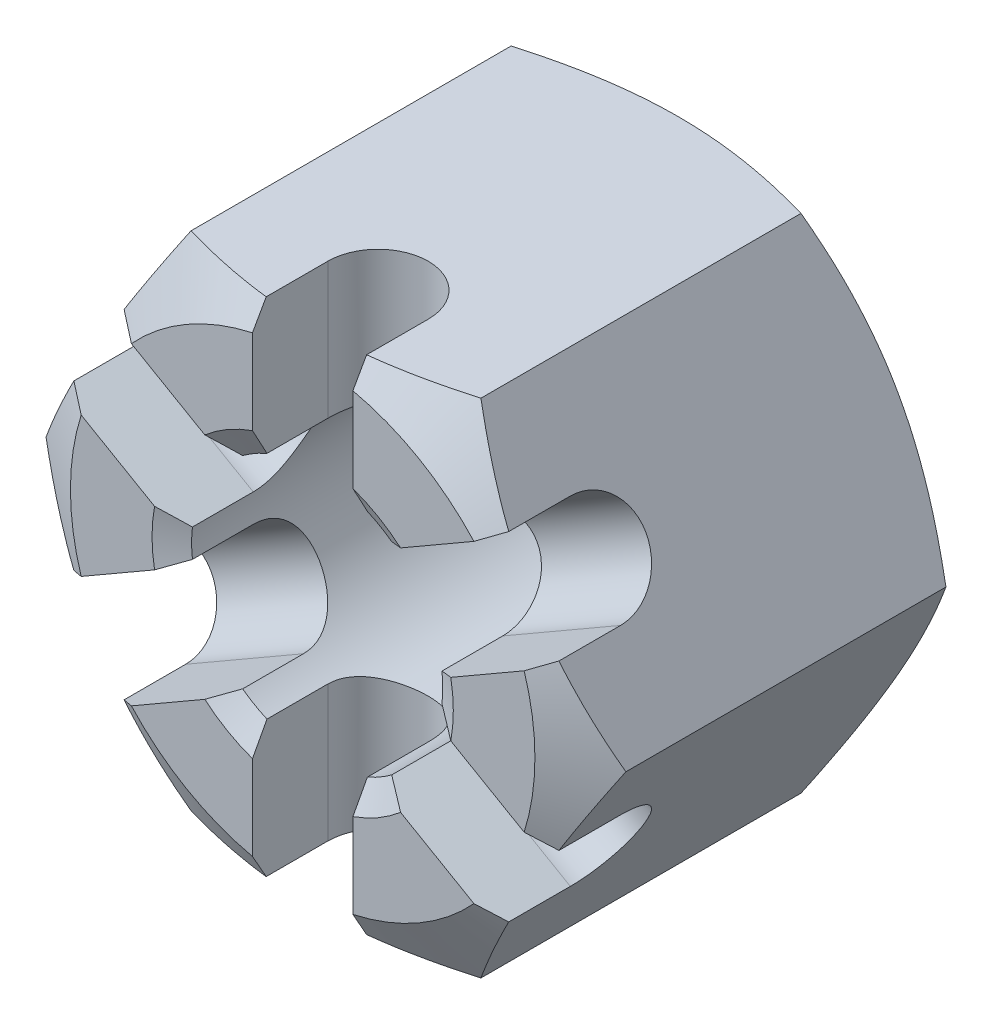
from build123d import *
from OCP.BRepFilletAPI import BRepFilletAPI_MakeChamfer

# Parameters (mm, degrees)
SKETCH1_R         = 2.5
BASENUT_DEPTH     = 7.7
ENDCHAMFER_SIZE   = 0.288675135
ENDCHAMFER_SIZE2  = 0.5
SLOT_DEPTH        = 11.845429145
SLOTPATTERN_COUNT = 3


with BuildPart() as part:
    # Sketch1 → BaseNut (new body)
    with BuildSketch(Plane.XY):
        Polygon((2.886751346, -5), (5.773502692, 0), (2.886751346, 5), (-2.886751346, 5), (-5.773502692, 0), (-2.886751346, -5), align=None)
        Circle(SKETCH1_R, mode=Mode.SUBTRACT)
    extrude(amount=-BASENUT_DEPTH)

    # Sketch2 → Double-Chamfer (revolve, cut)
    with BuildSketch(Plane(origin=(0, 0, 0), x_dir=(1, 0, 0), z_dir=(0, 1, 0))):
        Polygon((-5.773502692, 7.7), (-4.625, 7.7), (-5.773502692, 7.036911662), align=None)
        Polygon((-5.773502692, 0.663088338), (-5.773502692, 0), (-4.625, 0), align=None)
    revolve(axis=Axis((0, 0, -3.375940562), (0, 0, 1)), mode=Mode.SUBTRACT)

    # EndChamfer: one chamfer whose edges measure the first distance from different faces: ONE call of the kernel's chamfer builder (chamfer() names one face for all edges)
    endchamfer_edges_1 = [part.edges().sort_by_distance(p)[0] for p in [
        (-2.5, 0, -7.7),
    ]]
    endchamfer_side_1 = [part.faces().sort_by_distance(p)[0] for p in [
        (4.494185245, 0, -7.7),
    ]]
    endchamfer_edges_2 = [part.edges().sort_by_distance(p)[0] for p in [
        (-2.5, 0, 0),
    ]]
    endchamfer_side_2 = [part.faces().sort_by_distance(p)[0] for p in [
        (-2.5, 0, -3.85),
    ]]
    endchamfer = BRepFilletAPI_MakeChamfer(part.part.solid().wrapped)
    for e in endchamfer_edges_1:
        endchamfer.Add(ENDCHAMFER_SIZE, ENDCHAMFER_SIZE2, e.wrapped, endchamfer_side_1[0].wrapped)  # the first distance lies on this face
    for e in endchamfer_edges_2:
        endchamfer.Add(ENDCHAMFER_SIZE, ENDCHAMFER_SIZE2, e.wrapped, endchamfer_side_2[0].wrapped)  # the first distance lies on this face
    add(Compound.cast(endchamfer.Shape()), mode=Mode.REPLACE)

    # Sketch3 → Slot (cut, symmetric)
    with BuildSketch(Plane(origin=(0, 0, 0), x_dir=(1, 0, 0), z_dir=(0, 1, 0))):
        with BuildLine():
            Line((-1, -30.510518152), (-1, 0))
            Line((-1, 0), (-1, 1.5))
            ThreePointArc((-1, 1.5), (0, 2.5), (1, 1.5))
            Line((1, 1.5), (1, 0))
            Line((1, 0), (1, -30.510518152))
            Line((1, -30.510518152), (1, -91.531554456))
            Line((1, -91.531554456), (-1, -91.531554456))
            Line((-1, -91.531554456), (-1, -30.510518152))
        make_face()
    slot = extrude(amount=SLOT_DEPTH, both=True, mode=Mode.SUBTRACT)

    # SlotPattern: Slot ×3 about axis
    slotpattern_axis = Axis((0, 0, -3.375940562), (0, 0, 1))
    for i in range(1, SLOTPATTERN_COUNT):
        add(slot.rotate(slotpattern_axis, i * 360 / SLOTPATTERN_COUNT), mode=Mode.SUBTRACT)


solid = part.part
